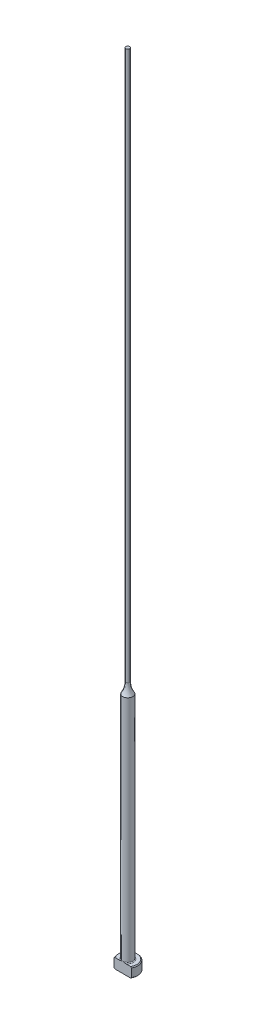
from build123d import *

# Parameters (mm, degrees)
CHAMFER1_SIZE      = 0.254
FILLET1_R          = 0.254
CUT_EXTRUDE1_DEPTH = 255.0396844


with BuildPart() as part:
    # Sketch1 → Revolve1 (revolve)
    with BuildSketch(Plane.XY, mode=Mode.PRIVATE) as revolve1_sk:
        with BuildLine():
            Line((0, 0), (-3.175, 0))
            Line((-3.175, 0), (-3.175, 3.175))
            Line((-3.175, 3.175), (-1.5875, 3.175))
            Line((-1.5875, 3.175), (-1.5875, 76.2))
            ThreePointArc((-1.5875, 76.2), (-0.847698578, 77.834042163), (-0.59436, 79.609772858))
            Line((-0.59436, 79.609772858), (-0.59436, 254))
            Line((-0.59436, 254), (0, 254))
            Line((0, 254), (0, 0))
        make_face()
    revolve(revolve1_sk.sketch.rotate(Axis((0, 259.958771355, 0), (0, -1, 0)), 270), axis=Axis((0, 259.958771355, 0), (0, -1, 0)))

    # Chamfer1
    chamfer1_edges = [part.edges().sort_by_distance(p)[0] for p in [
        (0, 0, -3.175),
        (0, 3.175, -3.175),
    ]]
    chamfer(chamfer1_edges, length=CHAMFER1_SIZE)

    # Fillet1
    fillet1_edges = [part.edges().sort_by_distance(p)[0] for p in [
        (0, 3.175, -1.5875),
    ]]
    fillet(fillet1_edges, radius=FILLET1_R)

    # Sketch2 → Cut-Extrude1 (cut, through all)
    with BuildSketch(Plane.XZ):
        with BuildLine():
            Line((-2.749630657, 1.5875), (2.749630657, 1.5875))
            ThreePointArc((2.749630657, 1.5875), (0, 3.175), (-2.749630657, 1.5875))
        make_face()
    extrude(amount=-CUT_EXTRUDE1_DEPTH, mode=Mode.SUBTRACT)


solid = part.part
